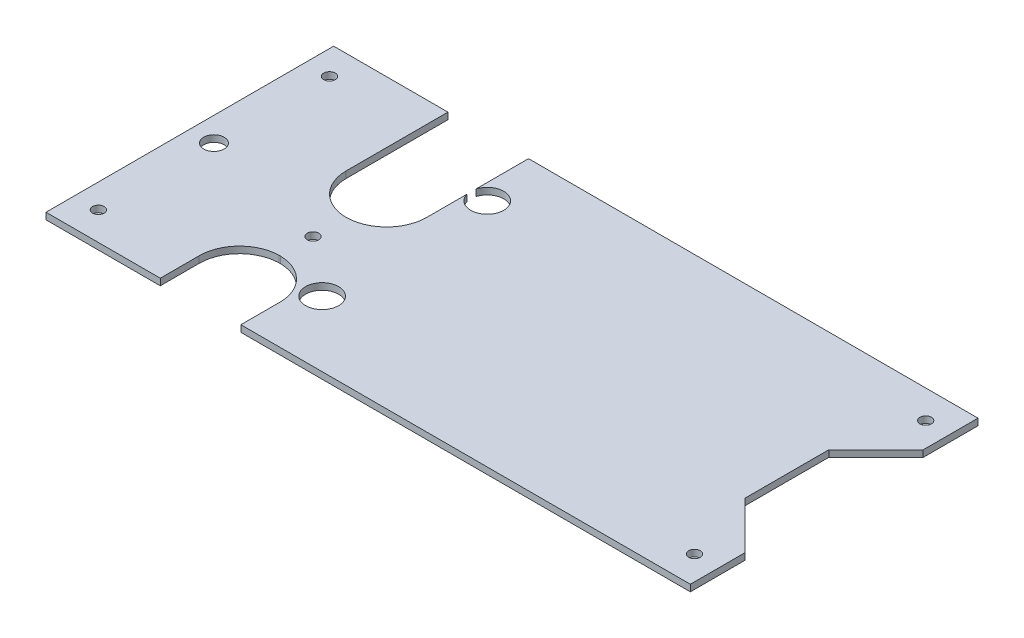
from build123d import *

# Parameters (mm, degrees)
ESQUISSE1_R        = 1.75
ESQUISSE1_R_2      = 3.1
ESQUISSE1_R_3      = 5
BOSS_EXTRU_1_DEPTH = 2


with BuildPart() as part:
    # Esquisse1 → Boss.-Extru.1 (new body)
    with BuildSketch(Plane(origin=(0, 0, 0), x_dir=(1, 0, 0), z_dir=(0, 1, 0))):
        with BuildLine():
            Line((-54.617606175, -33.702904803), (-54.617606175, -45.502904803))
            Line((-54.617606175, -45.502904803), (-89.217606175, -45.502904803))
            Line((-89.217606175, -45.502904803), (-89.217606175, 41.597095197))
            Line((-89.217606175, 41.597095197), (-54.617606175, 41.597095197))
            Line((-54.617606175, 41.597095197), (-54.617606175, 10.797095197))
            ThreePointArc((-54.617606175, 10.797095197), (-51.133707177, 2.260726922), (-42.671772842, -1.400256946))
            Line((-42.671772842, -1.400256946), (-42.163439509, -1.400256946))
            ThreePointArc((-42.163439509, -1.400256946), (-33.701505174, 2.260726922), (-30.217606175, 10.797095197))
            Line((-30.217606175, 10.797095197), (-30.217606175, 22.897026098))
            ThreePointArc((-30.217606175, 22.897026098), (-20.417628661, 24.297103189), (-30.217606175, 25.697180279))
            Line((-30.217606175, 25.697180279), (-30.217606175, 41.597095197))
            Line((-30.217606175, 41.597095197), (105.882393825, 41.597095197))
            Line((105.882393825, 41.597095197), (105.882393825, 25.01130876))
            Line((105.882393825, 25.01130876), (91.582393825, 10.71130876))
            Line((91.582393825, 10.71130876), (91.582393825, -14.617118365))
            Line((91.582393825, -14.617118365), (105.882393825, -28.917118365))
            Line((105.882393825, -28.917118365), (105.882393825, -45.502904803))
            Line((105.882393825, -45.502904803), (-30.217606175, -45.502904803))
            Line((-30.217606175, -45.502904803), (-30.217606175, -33.702904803))
            ThreePointArc((-30.217606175, -33.702904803), (-33.702480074, -25.165541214), (-42.166225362, -21.505494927))
            Line((-42.166225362, -21.505494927), (-42.668986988, -21.505494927))
            ThreePointArc((-42.668986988, -21.505494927), (-51.132732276, -25.165541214), (-54.617606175, -33.702904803))
        make_face()
        with Locations(Location((-81.917606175, 33.047095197, 0), (0, 0, 270))):
            Circle(ESQUISSE1_R, mode=Mode.SUBTRACT)
        with Locations(Location((-81.917606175, -36.952904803, 0), (0, 0, 270))):
            Circle(ESQUISSE1_R, mode=Mode.SUBTRACT)
        with Locations(Location((-81.917606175, -1.952904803, 0), (0, 0, 270))):
            Circle(ESQUISSE1_R_2, mode=Mode.SUBTRACT)
        with Locations(Location((-42.417606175, -11.452904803, 0), (0, 0, 270))):
            Circle(ESQUISSE1_R, mode=Mode.SUBTRACT)
        with Locations(Location((98.582393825, -36.952904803, 0), (0, 0, 270))):
            Circle(ESQUISSE1_R, mode=Mode.SUBTRACT)
        with Locations(Location((98.582393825, 33.047095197, 0), (0, 0, 270))):
            Circle(ESQUISSE1_R, mode=Mode.SUBTRACT)
        with Locations(Location((-25.417628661, -25.702896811, 0), (0, 0, 270))):
            Circle(ESQUISSE1_R_3, mode=Mode.SUBTRACT)
    extrude(amount=BOSS_EXTRU_1_DEPTH)


solid = part.part
